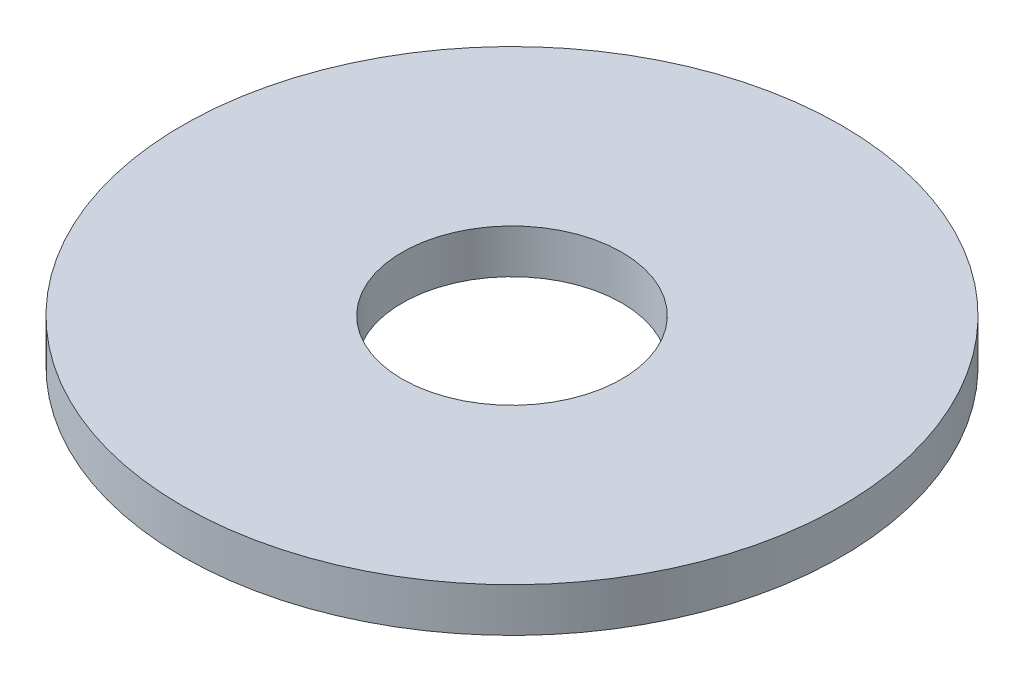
ISO-10303-21;
HEADER;
FILE_DESCRIPTION(('STEP AP214'),'2;1');
FILE_NAME('part.step','',(''),(''),'','','');
FILE_SCHEMA(('AUTOMOTIVE_DESIGN { 1 0 10303 214 1 1 1 1 }'));
ENDSEC;
DATA;
#1=APPLICATION_CONTEXT('core data for automotive mechanical design processes');
#2=APPLICATION_PROTOCOL_DEFINITION('international standard','automotive_design',2000,#1);
#3=PRODUCT_CONTEXT('',#1,'mechanical');
#4=PRODUCT('Part','Part','',(#3));
#5=PRODUCT_RELATED_PRODUCT_CATEGORY('part','',(#4));
#6=PRODUCT_DEFINITION_FORMATION('','',#4);
#7=PRODUCT_DEFINITION_CONTEXT('part definition',#1,'design');
#8=PRODUCT_DEFINITION('design','',#6,#7);
#9=PRODUCT_DEFINITION_SHAPE('','',#8);
#10=(LENGTH_UNIT() NAMED_UNIT(*) SI_UNIT(.MILLI.,.METRE.));
#11=(NAMED_UNIT(*) PLANE_ANGLE_UNIT() SI_UNIT($,.RADIAN.));
#12=(NAMED_UNIT(*) SI_UNIT($,.STERADIAN.) SOLID_ANGLE_UNIT());
#13=UNCERTAINTY_MEASURE_WITH_UNIT(LENGTH_MEASURE(1.E-05),#10,'distance_accuracy_value','');
#14=(GEOMETRIC_REPRESENTATION_CONTEXT(3) GLOBAL_UNCERTAINTY_ASSIGNED_CONTEXT((#13)) GLOBAL_UNIT_ASSIGNED_CONTEXT((#10,
#11,#12)) REPRESENTATION_CONTEXT('',''));
#15=CARTESIAN_POINT('',(0.,0.,0.));
#16=DIRECTION('',(0.,0.,1.));
#17=DIRECTION('',(1.,0.,0.));
#18=AXIS2_PLACEMENT_3D('',#15,#16,#17);
#19=CARTESIAN_POINT('',(0.,1.27,0.));
#20=DIRECTION('',(0.,1.,0.));
#21=DIRECTION('',(0.,0.,1.));
#22=AXIS2_PLACEMENT_3D('',#19,#20,#21);
#23=PLANE('',#22);
#24=CARTESIAN_POINT('',(0.,1.27,0.));
#25=DIRECTION('',(0.,1.,0.));
#26=DIRECTION('',(0.,0.,1.));
#27=AXIS2_PLACEMENT_3D('',#24,#25,#26);
#28=CIRCLE('',#27,9.525);
#29=CARTESIAN_POINT('',(0.,1.27,9.525));
#30=VERTEX_POINT('',#29);
#31=EDGE_CURVE('E10',#30,#30,#28,.T.);
#32=ORIENTED_EDGE('',*,*,#31,.T.);
#33=EDGE_LOOP('',(#32));
#34=FACE_BOUND('',#33,.T.);
#35=CARTESIAN_POINT('',(0.,1.27,0.));
#36=DIRECTION('',(0.,1.,0.));
#37=DIRECTION('',(0.,0.,1.));
#38=AXIS2_PLACEMENT_3D('',#35,#36,#37);
#39=CIRCLE('',#38,3.175);
#40=CARTESIAN_POINT('',(0.,1.27,3.175));
#41=VERTEX_POINT('',#40);
#42=EDGE_CURVE('E50',#41,#41,#39,.T.);
#43=ORIENTED_EDGE('',*,*,#42,.F.);
#44=EDGE_LOOP('',(#43));
#45=FACE_BOUND('',#44,.T.);
#46=ADVANCED_FACE('F37',(#34,#45),#23,.T.);
#47=CARTESIAN_POINT('',(0.,0.,0.));
#48=DIRECTION('',(0.,1.,0.));
#49=DIRECTION('',(0.,0.,1.));
#50=AXIS2_PLACEMENT_3D('',#47,#48,#49);
#51=PLANE('',#50);
#52=CARTESIAN_POINT('',(0.,0.,0.));
#53=DIRECTION('',(0.,1.,0.));
#54=DIRECTION('',(0.,0.,1.));
#55=AXIS2_PLACEMENT_3D('',#52,#53,#54);
#56=CIRCLE('',#55,9.525);
#57=CARTESIAN_POINT('',(0.,0.,9.525));
#58=VERTEX_POINT('',#57);
#59=EDGE_CURVE('E41',#58,#58,#56,.T.);
#60=ORIENTED_EDGE('',*,*,#59,.F.);
#61=EDGE_LOOP('',(#60));
#62=FACE_BOUND('',#61,.T.);
#63=CARTESIAN_POINT('',(0.,0.,0.));
#64=DIRECTION('',(0.,1.,0.));
#65=DIRECTION('',(0.,0.,1.));
#66=AXIS2_PLACEMENT_3D('',#63,#64,#65);
#67=CIRCLE('',#66,3.175);
#68=CARTESIAN_POINT('',(0.,0.,3.175));
#69=VERTEX_POINT('',#68);
#70=EDGE_CURVE('E52',#69,#69,#67,.T.);
#71=ORIENTED_EDGE('',*,*,#70,.T.);
#72=EDGE_LOOP('',(#71));
#73=FACE_BOUND('',#72,.T.);
#74=ADVANCED_FACE('F64',(#62,#73),#51,.F.);
#75=CARTESIAN_POINT('',(0.,1.27,0.));
#76=DIRECTION('',(0.,-1.,0.));
#77=DIRECTION('',(0.,0.,-1.));
#78=AXIS2_PLACEMENT_3D('',#75,#76,#77);
#79=CYLINDRICAL_SURFACE('',#78,9.525);
#80=ORIENTED_EDGE('',*,*,#31,.F.);
#81=EDGE_LOOP('',(#80));
#82=FACE_BOUND('',#81,.T.);
#83=ORIENTED_EDGE('',*,*,#59,.T.);
#84=EDGE_LOOP('',(#83));
#85=FACE_BOUND('',#84,.T.);
#86=ADVANCED_FACE('F39',(#82,#85),#79,.T.);
#87=CARTESIAN_POINT('',(0.,1.27,0.));
#88=DIRECTION('',(0.,-1.,0.));
#89=DIRECTION('',(0.,0.,-1.));
#90=AXIS2_PLACEMENT_3D('',#87,#88,#89);
#91=CYLINDRICAL_SURFACE('',#90,3.175);
#92=ORIENTED_EDGE('',*,*,#42,.T.);
#93=EDGE_LOOP('',(#92));
#94=FACE_BOUND('',#93,.T.);
#95=ORIENTED_EDGE('',*,*,#70,.F.);
#96=EDGE_LOOP('',(#95));
#97=FACE_BOUND('',#96,.T.);
#98=ADVANCED_FACE('F60',(#94,#97),#91,.F.);
#99=CLOSED_SHELL('',(#46,#74,#86,#98));
#100=MANIFOLD_SOLID_BREP('B2',#99);
#101=ADVANCED_BREP_SHAPE_REPRESENTATION('',(#18,#100),#14);
#102=SHAPE_DEFINITION_REPRESENTATION(#9,#101);
ENDSEC;
END-ISO-10303-21;
